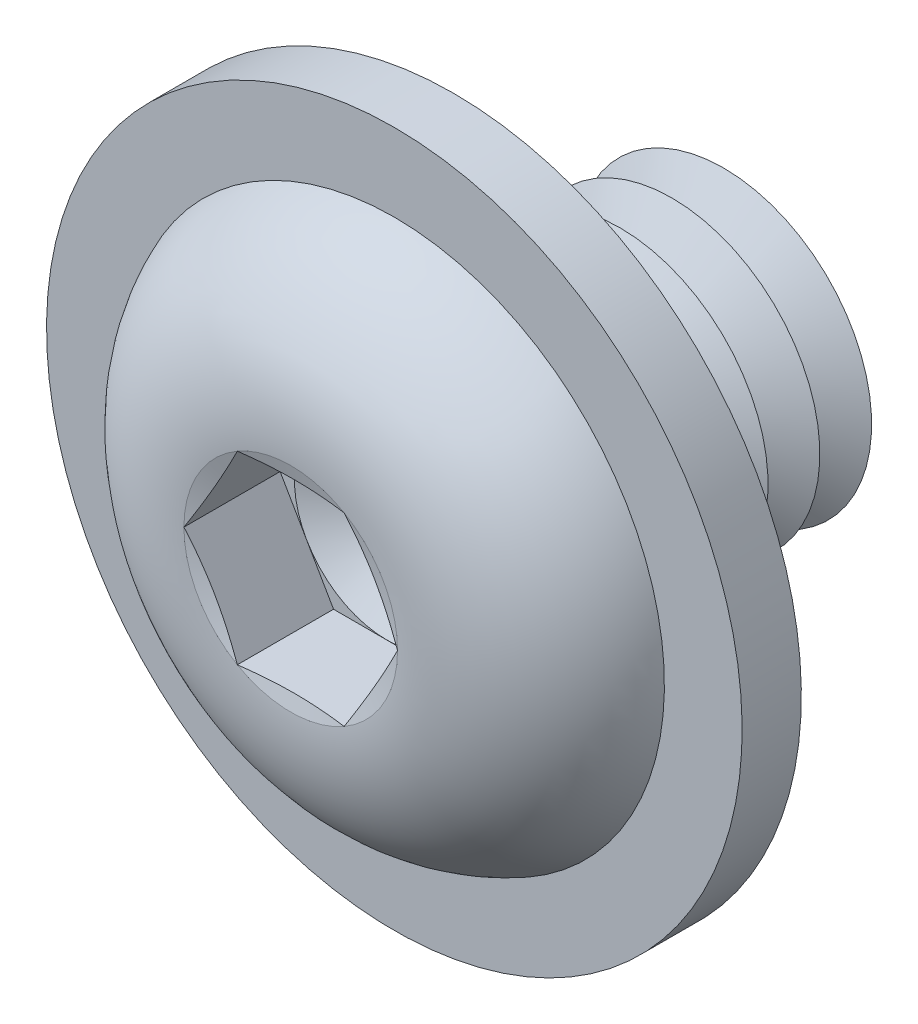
from build123d import *

# Parameters (mm, degrees)
FILLET1_R           = 0.35
LPATTERN1_COUNT     = 5
LPATTERN1_PITCH     = 0.7
CUT_EXTRUDE1_DEPTH  = 1.3
SKETCH5_R           = 4.7
SKETCH5_R_2         = 2.35
BOSS_EXTRUDE1_DEPTH = 0.8


with BuildPart() as part:
    # Sketch1 → Revolve1 (revolve)
    with BuildSketch(Plane(origin=(0, 0, 0), x_dir=(0, 0, -1), z_dir=(1, 0, 0))):
        with BuildLine():
            Line((0, 2), (0, 3.8))
            ThreePointArc((0, 3.8), (-1.611961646, 3.099623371), (-2.2, 1.443375))
            Line((-2.2, 1.443375), (-2.006624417, 0.7216875))
            Line((-2.006624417, 0.7216875), (-2.2, 0.7216875))
            Line((-2.2, 0.7216875), (-2.2, 0))
            Line((-2.2, 0), (4, 0))
            Line((4, 0), (4, 2))
            Line((4, 2), (0, 2))
        make_face()
    revolve(axis=Axis((0, 0, -4), (0, 0, 1)))

    # Fillet1
    fillet1_edges = [part.edges().sort_by_distance(p)[0] for p in [
        (0, -2, 0),
    ]]
    fillet(fillet1_edges, radius=FILLET1_R)

    # Sketch2 → Cut-Revolve1 (revolve, cut)
    with BuildSketch(Plane(origin=(0, 0, 0), x_dir=(0, 0, -1), z_dir=(1, 0, 0))):
        Polygon((3.65, 2), (4.35, 2), (4, 1.393782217), align=None)
    cut_revolve1 = revolve(axis=Axis((0, 0, -4), (0, 0, -1)), mode=Mode.SUBTRACT)

    # LPattern1: Cut-Revolve1 ×5
    with Locations(*[(0, 0, i * LPATTERN1_PITCH) for i in range(1, LPATTERN1_COUNT)]):
        add(cut_revolve1, mode=Mode.SUBTRACT)

    # Sketch3 → Cut-Extrude1 (cut)
    with BuildSketch(Plane.XY.offset(2.2)):
        Polygon((0.7216875, 1.249999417), (-0.7216875, 1.249999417), (-1.443375, 0), (-0.7216875, -1.249999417), (0.7216875, -1.249999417), (1.443375, 0), align=None)
    extrude(amount=-CUT_EXTRUDE1_DEPTH, mode=Mode.SUBTRACT)

    # Cut-Extrude2 cone 1 section (on through the dimple's axis) → Cut-Extrude2 (revolve, cut)
    with BuildSketch(Plane(origin=(0, 0, 0.9), x_dir=(0, -1, 0), z_dir=(1, 0, 0))):
        Polygon((0, 0), (1.249999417, 0), (0, 0.7216875), align=None)
    revolve(axis=Axis((0, 0, 0.9), (0, 0, -1)), mode=Mode.SUBTRACT)

    # Sketch5 → Boss-Extrude1 (add)
    with BuildSketch(Plane(origin=(0, 0, 0), x_dir=(-1, 0, 0), z_dir=(0, 0, -1))):
        with Locations(Location((0, 0, 0), (0, 0, 90))):
            Circle(SKETCH5_R)
        Circle(SKETCH5_R_2, mode=Mode.SUBTRACT)
    extrude(amount=-BOSS_EXTRUDE1_DEPTH)


solid = part.part
